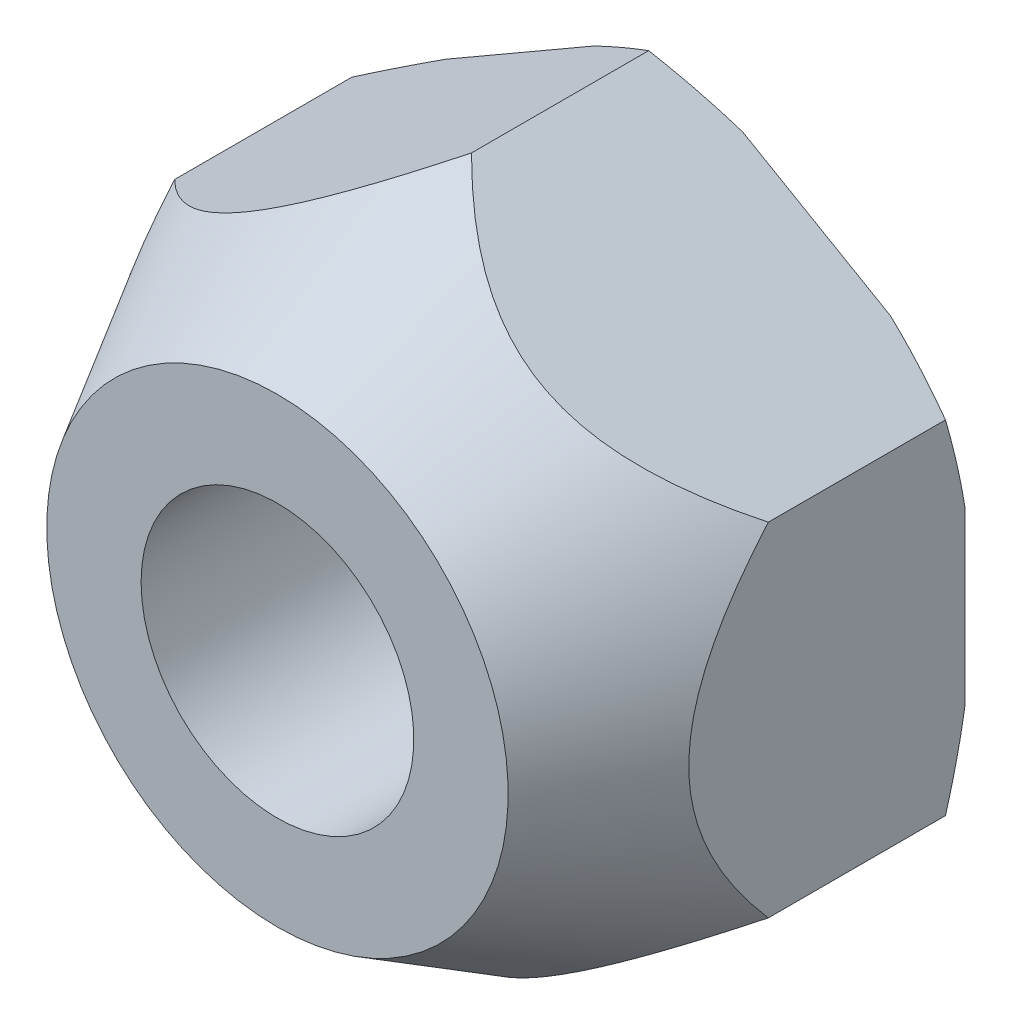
from build123d import *

# Parameters (mm, degrees)
BASENUTSKE_W = 7.3152
BASENUTSKE_H = 3.00355
HEX_START    = 7.3152
HEXSKE_R     = 2.5527
HEX_2_DEPTH  = 7.3152


with BuildPart() as part:
    # BaseNutSke → BaseNut (revolve)
    with BuildSketch(Plane(origin=(0, 0, 0), x_dir=(0, 0, -1), z_dir=(1, 0, 0)), mode=Mode.PRIVATE) as basenut_sk:
        with Locations((-3.6576, 4.054475)):
            Rectangle(BASENUTSKE_W, BASENUTSKE_H)
    revolve(basenut_sk.sketch.rotate(Axis((0, 0, 0), (0, 0, 1)), 90), axis=Axis((0, 0, 0), (0, 0, 1)))

    # HexSke → Hex 2 (add)
    with BuildSketch(Plane.XY.offset(HEX_START)):
        Polygon((5.55625, -3.207902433), (5.55625, 3.207902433), (0, 6.415804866), (-5.55625, 3.207902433), (-5.55625, -3.207902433), (0, -6.415804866), align=None)
        with Locations(Location((0, 0, 0), (0, 0, 180))):
            Circle(HEXSKE_R, mode=Mode.SUBTRACT)
    extrude(amount=-HEX_2_DEPTH)

    # FilletSke → HexFillet (revolve, cut)
    with BuildSketch(Plane(origin=(0, 0, 0), x_dir=(0, 0, -1), z_dir=(1, 0, 0))):
        Polygon((-7.3152, 4.318753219), (-3.683, 6.415804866), (-7.3152, 6.415804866), align=None)
        Polygon((0, 6.415804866), (0, 5.780804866), (-0.366617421, 6.415804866), align=None)
    revolve(axis=Axis((0, 0, 0), (0, 0, 1)), mode=Mode.SUBTRACT)

    # ThdSchSke → ThreadSchematic (revolve, cut)
    with BuildSketch(Plane(origin=(0, 0, 0), x_dir=(0, 0, -1), z_dir=(1, 0, 0)), mode=Mode.PRIVATE) as threadschematic_sk:
        Polygon((-0.359285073, 2.5527), (0, 3.175), (0.359285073, 2.5527), align=None)
    revolve(threadschematic_sk.sketch.rotate(Axis((0, 0, 0), (0, 0, 1)), 90), axis=Axis((0, 0, 0), (0, 0, 1)), mode=Mode.SUBTRACT)


solid = part.part
